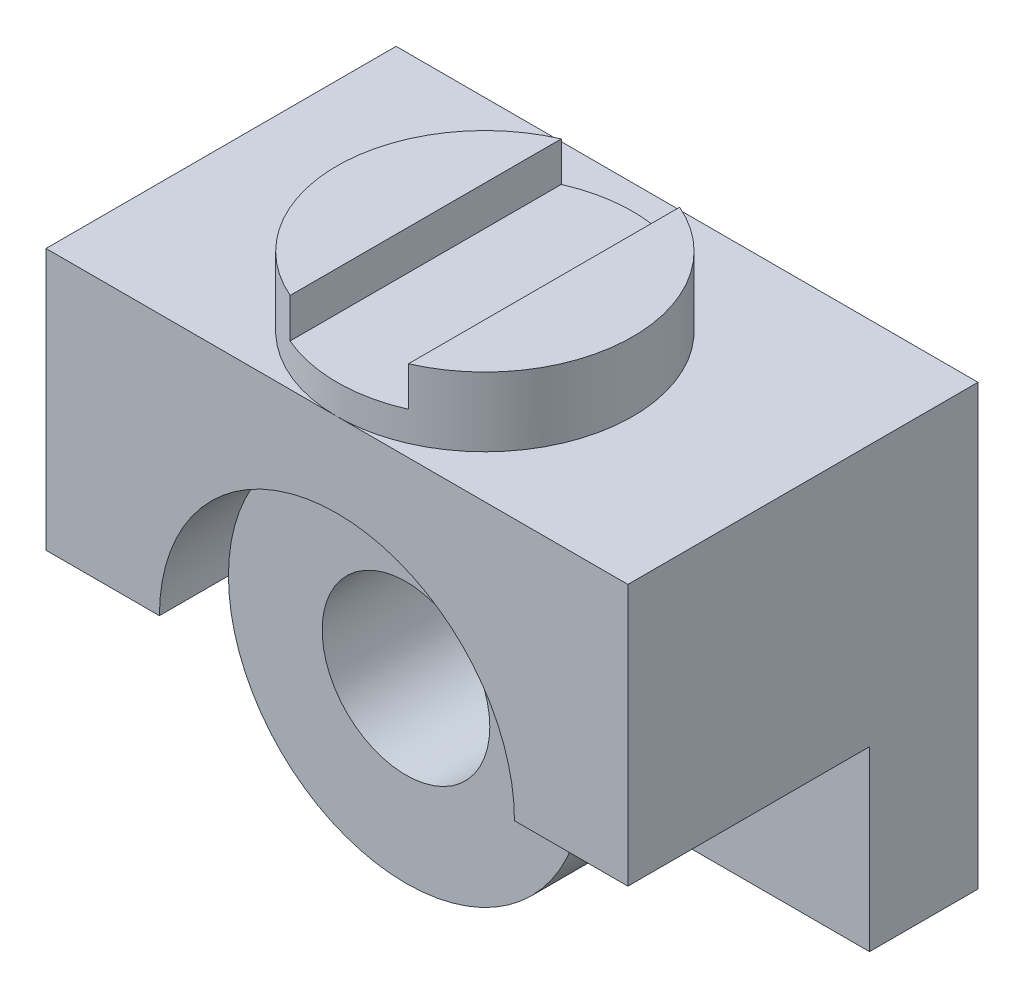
from build123d import *

# Parameters (mm, degrees)
EXTRUDE_1_DEPTH           = 60
EXTRUDE_1_DEPTH_BACK      = 82
SKETCH_1_W                = 236
SKETCH_1_H                = 178
SKETCH_2_R                = 34
CUT_EXTRUDE_16_DEPTH      = 213.894339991
CUT_EXTRUDE_18_DEPTH      = 98
SKETCH_2_12_R             = 72
CUT_EXTRUDE_19_DEPTH      = 28
SKETCH_3_R                = 60
EXTRUDE_2_DEPTH           = 28
CUT_EXTRUDE_20_DEPTH      = 197.479006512
CUT_EXTRUDE_20_DEPTH_BACK = 197.479006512
SKETCH_4_W                = 48
SKETCH_4_H                = 16


with BuildPart() as part:
    # Sketch 1 → Extrude 1 (new, two sides: drawn at the far end of the back side and taken through both)
    with BuildSketch(Plane.XY.offset(-EXTRUDE_1_DEPTH_BACK)):
        with Locations((0, 17)):
            Rectangle(SKETCH_1_W, SKETCH_1_H)
    extrude(amount=EXTRUDE_1_DEPTH + EXTRUDE_1_DEPTH_BACK)

    # Sketch 2 → Cut-Extrude 16 (cut, through all)
    with BuildSketch(Plane.XY.offset(60)):
        Circle(SKETCH_2_R)
    extrude(amount=-CUT_EXTRUDE_16_DEPTH, mode=Mode.SUBTRACT)

    # Sketch 2_11 → Cut-Extrude 18 (cut)
    with BuildSketch(Plane.XY.offset(60)):
        with BuildLine():
            Line((-72, 0), (-118, 0))
            Line((-118, 0), (-118, -72))
            Line((-118, -72), (0, -72))
            ThreePointArc((0, -72), (-50.911688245, -50.911688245), (-72, 0))
        make_face()
        with BuildLine():
            Line((118, 0), (72, 0))
            ThreePointArc((72, 0), (50.911688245, -50.911688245), (0, -72))
            Line((0, -72), (118, -72))
            Line((118, -72), (118, 0))
        make_face()
    extrude(amount=-CUT_EXTRUDE_18_DEPTH, mode=Mode.SUBTRACT)

    # Sketch 2_12 → Cut-Extrude 19 (cut)
    with BuildSketch(Plane.XY.offset(60)):
        Circle(SKETCH_2_12_R)
    extrude(amount=-CUT_EXTRUDE_19_DEPTH, mode=Mode.SUBTRACT)

    # Sketch 3 → Extrude 2 (add)
    with BuildSketch(Plane(origin=(0, 106, 0), x_dir=(1, 0, 0), z_dir=(0, 1, 0))):
        with Locations(Location((0, 0, 0), (0, 0, 270))):
            Circle(SKETCH_3_R)
    extrude(amount=EXTRUDE_2_DEPTH)

    # Sketch 4 → Cut-Extrude 20 (cut, two sides: drawn at the far end of the back side and taken through both)
    with BuildSketch(Plane.XY.offset(-CUT_EXTRUDE_20_DEPTH_BACK)):
        with Locations((0, 126)):
            Rectangle(SKETCH_4_W, SKETCH_4_H)
    extrude(amount=CUT_EXTRUDE_20_DEPTH + CUT_EXTRUDE_20_DEPTH_BACK, mode=Mode.SUBTRACT)


solid = part.part
